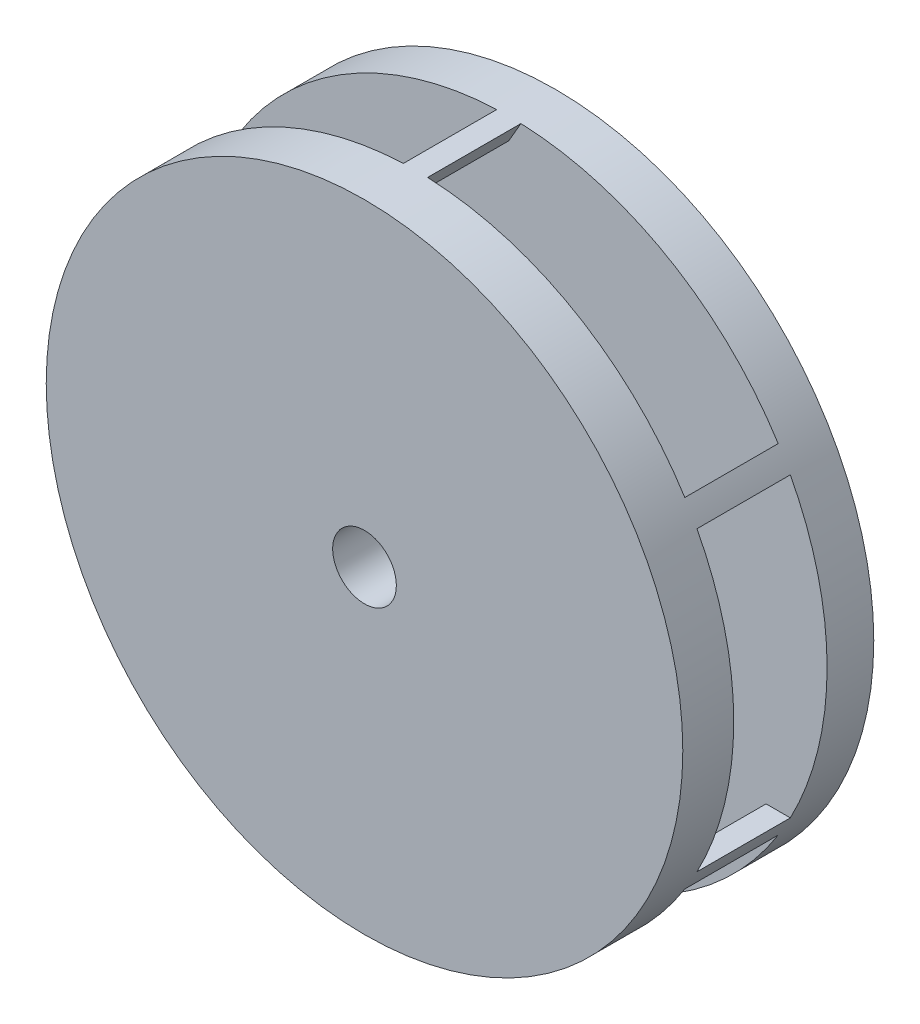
ISO-10303-21;
HEADER;
FILE_DESCRIPTION(('STEP AP214'),'2;1');
FILE_NAME('part.step','',(''),(''),'','','');
FILE_SCHEMA(('AUTOMOTIVE_DESIGN { 1 0 10303 214 1 1 1 1 }'));
ENDSEC;
DATA;
#1=APPLICATION_CONTEXT('core data for automotive mechanical design processes');
#2=APPLICATION_PROTOCOL_DEFINITION('international standard','automotive_design',2000,#1);
#3=PRODUCT_CONTEXT('',#1,'mechanical');
#4=PRODUCT('Part','Part','',(#3));
#5=PRODUCT_RELATED_PRODUCT_CATEGORY('part','',(#4));
#6=PRODUCT_DEFINITION_FORMATION('','',#4);
#7=PRODUCT_DEFINITION_CONTEXT('part definition',#1,'design');
#8=PRODUCT_DEFINITION('design','',#6,#7);
#9=PRODUCT_DEFINITION_SHAPE('','',#8);
#10=(LENGTH_UNIT() NAMED_UNIT(*) SI_UNIT(.MILLI.,.METRE.));
#11=(NAMED_UNIT(*) PLANE_ANGLE_UNIT() SI_UNIT($,.RADIAN.));
#12=(NAMED_UNIT(*) SI_UNIT($,.STERADIAN.) SOLID_ANGLE_UNIT());
#13=UNCERTAINTY_MEASURE_WITH_UNIT(LENGTH_MEASURE(1.E-05),#10,'distance_accuracy_value','');
#14=(GEOMETRIC_REPRESENTATION_CONTEXT(3) GLOBAL_UNCERTAINTY_ASSIGNED_CONTEXT((#13)) GLOBAL_UNIT_ASSIGNED_CONTEXT((#10,
#11,#12)) REPRESENTATION_CONTEXT('',''));
#15=CARTESIAN_POINT('',(0.,0.,0.));
#16=DIRECTION('',(0.,0.,1.));
#17=DIRECTION('',(1.,0.,0.));
#18=AXIS2_PLACEMENT_3D('',#15,#16,#17);
#19=CARTESIAN_POINT('',(-81.5375247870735,71.2271356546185,33.));
#20=DIRECTION('',(-0.86602540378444,-0.499999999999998,0.));
#21=DIRECTION('',(0.499999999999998,-0.86602540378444,0.));
#22=AXIS2_PLACEMENT_3D('',#19,#20,#21);
#23=PLANE('',#22);
#24=DIRECTION('',(0.499999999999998,-0.86602540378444,0.));
#25=VECTOR('',#24,1.);
#26=CARTESIAN_POINT('',(-81.5375247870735,71.2271356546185,11.));
#27=LINE('',#26,#25);
#28=CARTESIAN_POINT('',(-2.56739074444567E-13,-69.9999999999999,11.));
#29=VERTEX_POINT('',#28);
#30=CARTESIAN_POINT('',(2.85535877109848,-74.9456264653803,11.));
#31=VERTEX_POINT('',#30);
#32=EDGE_CURVE('E253',#29,#31,#27,.T.);
#33=ORIENTED_EDGE('',*,*,#32,.F.);
#34=DIRECTION('',(0.,0.,1.));
#35=VECTOR('',#34,1.);
#36=CARTESIAN_POINT('',(-2.4980018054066E-13,-69.9999999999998,33.));
#37=LINE('',#36,#35);
#38=CARTESIAN_POINT('',(-2.35922392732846E-13,-69.9999999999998,33.));
#39=VERTEX_POINT('',#38);
#40=EDGE_CURVE('E213',#29,#39,#37,.T.);
#41=ORIENTED_EDGE('',*,*,#40,.T.);
#42=DIRECTION('',(0.499999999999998,-0.86602540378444,0.));
#43=VECTOR('',#42,1.);
#44=CARTESIAN_POINT('',(-81.5375247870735,71.2271356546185,33.));
#45=LINE('',#44,#43);
#46=CARTESIAN_POINT('',(2.85535877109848,-74.9456264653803,33.));
#47=VERTEX_POINT('',#46);
#48=EDGE_CURVE('E257',#39,#47,#45,.T.);
#49=ORIENTED_EDGE('',*,*,#48,.T.);
#50=DIRECTION('',(0.,0.,-1.));
#51=VECTOR('',#50,1.);
#52=CARTESIAN_POINT('',(2.85535877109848,-74.9456264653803,45.));
#53=LINE('',#52,#51);
#54=EDGE_CURVE('E241',#47,#31,#53,.T.);
#55=ORIENTED_EDGE('',*,*,#54,.T.);
#56=EDGE_LOOP('',(#33,#41,#49,#55));
#57=FACE_BOUND('',#56,.T.);
#58=ADVANCED_FACE('F30',(#57),#23,.F.);
#59=CARTESIAN_POINT('',(-20.9157465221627,106.227135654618,11.));
#60=DIRECTION('',(0.86602540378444,0.499999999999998,0.));
#61=DIRECTION('',(-0.499999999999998,0.86602540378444,0.));
#62=AXIS2_PLACEMENT_3D('',#59,#60,#61);
#63=PLANE('',#62);
#64=DIRECTION('',(0.499999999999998,-0.86602540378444,0.));
#65=VECTOR('',#64,1.);
#66=CARTESIAN_POINT('',(-20.9157465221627,106.227135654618,33.));
#67=LINE('',#66,#65);
#68=CARTESIAN_POINT('',(60.6217782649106,-35.,33.));
#69=VERTEX_POINT('',#68);
#70=CARTESIAN_POINT('',(63.4771370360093,-39.9456264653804,33.));
#71=VERTEX_POINT('',#70);
#72=EDGE_CURVE('E261',#69,#71,#67,.T.);
#73=ORIENTED_EDGE('',*,*,#72,.F.);
#74=DIRECTION('',(0.,0.,-1.));
#75=VECTOR('',#74,1.);
#76=CARTESIAN_POINT('',(60.6217782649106,-35.,11.));
#77=LINE('',#76,#75);
#78=CARTESIAN_POINT('',(60.6217782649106,-35.,11.));
#79=VERTEX_POINT('',#78);
#80=EDGE_CURVE('E172',#69,#79,#77,.T.);
#81=ORIENTED_EDGE('',*,*,#80,.T.);
#82=DIRECTION('',(0.499999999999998,-0.86602540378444,0.));
#83=VECTOR('',#82,1.);
#84=CARTESIAN_POINT('',(-20.9157465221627,106.227135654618,11.));
#85=LINE('',#84,#83);
#86=CARTESIAN_POINT('',(63.4771370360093,-39.9456264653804,11.));
#87=VERTEX_POINT('',#86);
#88=EDGE_CURVE('E249',#79,#87,#85,.T.);
#89=ORIENTED_EDGE('',*,*,#88,.T.);
#90=DIRECTION('',(0.,0.,-1.));
#91=VECTOR('',#90,1.);
#92=CARTESIAN_POINT('',(63.4771370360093,-39.9456264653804,45.));
#93=LINE('',#92,#91);
#94=EDGE_CURVE('E235',#87,#71,#93,.F.);
#95=ORIENTED_EDGE('',*,*,#94,.T.);
#96=EDGE_LOOP('',(#73,#81,#89,#95));
#97=FACE_BOUND('',#96,.T.);
#98=ADVANCED_FACE('F292',(#97),#63,.F.);
#99=CARTESIAN_POINT('',(0.,0.,-15.));
#100=DIRECTION('',(0.,0.,1.));
#101=DIRECTION('',(1.,0.,0.));
#102=AXIS2_PLACEMENT_3D('',#99,#100,#101);
#103=CYLINDRICAL_SURFACE('',#102,30.5);
#104=CARTESIAN_POINT('',(0.,0.,-15.));
#105=DIRECTION('',(0.,0.,-1.));
#106=DIRECTION('',(-1.,0.,0.));
#107=AXIS2_PLACEMENT_3D('',#104,#105,#106);
#108=CIRCLE('',#107,30.5);
#109=CARTESIAN_POINT('',(-30.5,0.,-15.));
#110=VERTEX_POINT('',#109);
#111=EDGE_CURVE('E403',#110,#110,#108,.T.);
#112=ORIENTED_EDGE('',*,*,#111,.F.);
#113=EDGE_LOOP('',(#112));
#114=FACE_BOUND('',#113,.T.);
#115=CARTESIAN_POINT('',(0.,0.,-9.));
#116=DIRECTION('',(0.,0.,1.));
#117=DIRECTION('',(1.,0.,0.));
#118=AXIS2_PLACEMENT_3D('',#115,#116,#117);
#119=CIRCLE('',#118,30.5);
#120=CARTESIAN_POINT('',(30.5,0.,-9.));
#121=VERTEX_POINT('',#120);
#122=EDGE_CURVE('E394',#121,#121,#119,.T.);
#123=ORIENTED_EDGE('',*,*,#122,.F.);
#124=EDGE_LOOP('',(#123));
#125=FACE_BOUND('',#124,.T.);
#126=ADVANCED_FACE('F288',(#114,#125),#103,.T.);
#127=CARTESIAN_POINT('',(0.,0.,-15.));
#128=DIRECTION('',(0.,0.,-1.));
#129=DIRECTION('',(-1.,0.,0.));
#130=AXIS2_PLACEMENT_3D('',#127,#128,#129);
#131=PLANE('',#130);
#132=ORIENTED_EDGE('',*,*,#111,.T.);
#133=EDGE_LOOP('',(#132));
#134=FACE_BOUND('',#133,.T.);
#135=CARTESIAN_POINT('',(0.,0.,-15.));
#136=DIRECTION('',(0.,0.,-1.));
#137=DIRECTION('',(-1.,0.,0.));
#138=AXIS2_PLACEMENT_3D('',#135,#136,#137);
#139=CIRCLE('',#138,25.5);
#140=CARTESIAN_POINT('',(-25.5,0.,-15.));
#141=VERTEX_POINT('',#140);
#142=EDGE_CURVE('E252',#141,#141,#139,.T.);
#143=ORIENTED_EDGE('',*,*,#142,.F.);
#144=EDGE_LOOP('',(#143));
#145=FACE_BOUND('',#144,.T.);
#146=ADVANCED_FACE('F284',(#134,#145),#131,.T.);
#147=CARTESIAN_POINT('',(0.,0.,-15.));
#148=DIRECTION('',(0.,0.,1.));
#149=DIRECTION('',(1.,0.,0.));
#150=AXIS2_PLACEMENT_3D('',#147,#148,#149);
#151=CYLINDRICAL_SURFACE('',#150,25.5);
#152=ORIENTED_EDGE('',*,*,#142,.T.);
#153=EDGE_LOOP('',(#152));
#154=FACE_BOUND('',#153,.T.);
#155=CARTESIAN_POINT('',(0.,0.,11.));
#156=DIRECTION('',(0.,0.,-1.));
#157=DIRECTION('',(-1.,0.,0.));
#158=AXIS2_PLACEMENT_3D('',#155,#156,#157);
#159=CIRCLE('',#158,25.5);
#160=CARTESIAN_POINT('',(-25.5,0.,11.));
#161=VERTEX_POINT('',#160);
#162=EDGE_CURVE('E356',#161,#161,#159,.F.);
#163=ORIENTED_EDGE('',*,*,#162,.T.);
#164=EDGE_LOOP('',(#163));
#165=FACE_BOUND('',#164,.T.);
#166=ADVANCED_FACE('F279',(#154,#165),#151,.F.);
#167=CARTESIAN_POINT('',(-30.5,0.,-9.));
#168=CARTESIAN_POINT('',(-38.5213748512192,0.,-2.27671658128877));
#169=CARTESIAN_POINT('',(-65.5,0.,0.));
#170=B_SPLINE_CURVE_WITH_KNOTS('',2,(#167,#168,#169),.UNSPECIFIED.,.F.,.F.,(3,3),(0.,
0.452791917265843),.UNSPECIFIED.);
#171=CARTESIAN_POINT('',(0.,0.,0.));
#172=DIRECTION('',(0.,0.,1.));
#173=AXIS1_PLACEMENT('',#171,#172);
#174=SURFACE_OF_REVOLUTION('',#170,#173);
#175=CARTESIAN_POINT('',(0.,0.,0.));
#176=DIRECTION('',(0.,0.,1.));
#177=DIRECTION('',(1.,0.,0.));
#178=AXIS2_PLACEMENT_3D('',#175,#176,#177);
#179=CIRCLE('',#178,65.5);
#180=CARTESIAN_POINT('',(65.5,0.,0.));
#181=VERTEX_POINT('',#180);
#182=EDGE_CURVE('E392',#181,#181,#179,.F.);
#183=ORIENTED_EDGE('',*,*,#182,.T.);
#184=EDGE_LOOP('',(#183));
#185=FACE_BOUND('',#184,.T.);
#186=ORIENTED_EDGE('',*,*,#122,.T.);
#187=EDGE_LOOP('',(#186));
#188=FACE_BOUND('',#187,.T.);
#189=ADVANCED_FACE('F274',(#185,#188),#174,.T.);
#190=CARTESIAN_POINT('',(0.,0.,45.));
#191=DIRECTION('',(0.,0.,1.));
#192=DIRECTION('',(1.,0.,0.));
#193=AXIS2_PLACEMENT_3D('',#190,#191,#192);
#194=PLANE('',#193);
#195=CARTESIAN_POINT('',(0.,0.,45.));
#196=DIRECTION('',(0.,0.,1.));
#197=DIRECTION('',(1.,0.,0.));
#198=AXIS2_PLACEMENT_3D('',#195,#196,#197);
#199=CIRCLE('',#198,7.5);
#200=CARTESIAN_POINT('',(7.5,0.,45.));
#201=VERTEX_POINT('',#200);
#202=EDGE_CURVE('E416',#201,#201,#199,.T.);
#203=ORIENTED_EDGE('',*,*,#202,.F.);
#204=EDGE_LOOP('',(#203));
#205=FACE_BOUND('',#204,.T.);
#206=CARTESIAN_POINT('',(0.,0.,45.));
#207=DIRECTION('',(0.,0.,1.));
#208=DIRECTION('',(1.,0.,0.));
#209=AXIS2_PLACEMENT_3D('',#206,#207,#208);
#210=CIRCLE('',#209,75.);
#211=CARTESIAN_POINT('',(75.,0.,45.));
#212=VERTEX_POINT('',#211);
#213=EDGE_CURVE('E399',#212,#212,#210,.T.);
#214=ORIENTED_EDGE('',*,*,#213,.T.);
#215=EDGE_LOOP('',(#214));
#216=FACE_BOUND('',#215,.T.);
#217=ADVANCED_FACE('F278',(#205,#216),#194,.T.);
#218=CARTESIAN_POINT('',(0.,0.,45.));
#219=DIRECTION('',(0.,0.,-1.));
#220=DIRECTION('',(-1.,0.,0.));
#221=AXIS2_PLACEMENT_3D('',#218,#219,#220);
#222=CYLINDRICAL_SURFACE('',#221,75.);
#223=CARTESIAN_POINT('',(0.,0.,11.));
#224=DIRECTION('',(0.,0.,-1.));
#225=DIRECTION('',(-1.,0.,0.));
#226=AXIS2_PLACEMENT_3D('',#223,#224,#225);
#227=CIRCLE('',#226,75.);
#228=CARTESIAN_POINT('',(66.332495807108,35.,11.));
#229=VERTEX_POINT('',#228);
#230=CARTESIAN_POINT('',(66.332495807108,-35.,11.));
#231=VERTEX_POINT('',#230);
#232=EDGE_CURVE('E160',#229,#231,#227,.T.);
#233=ORIENTED_EDGE('',*,*,#232,.T.);
#234=DIRECTION('',(0.,0.,-1.));
#235=VECTOR('',#234,1.);
#236=CARTESIAN_POINT('',(66.332495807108,-35.,45.));
#237=LINE('',#236,#235);
#238=CARTESIAN_POINT('',(66.332495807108,-35.,33.));
#239=VERTEX_POINT('',#238);
#240=EDGE_CURVE('E173',#231,#239,#237,.F.);
#241=ORIENTED_EDGE('',*,*,#240,.T.);
#242=CARTESIAN_POINT('',(0.,0.,33.));
#243=DIRECTION('',(0.,0.,1.));
#244=DIRECTION('',(0.,-1.,0.));
#245=AXIS2_PLACEMENT_3D('',#242,#243,#244);
#246=CIRCLE('',#245,75.);
#247=CARTESIAN_POINT('',(66.332495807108,35.,33.));
#248=VERTEX_POINT('',#247);
#249=EDGE_CURVE('E179',#239,#248,#246,.T.);
#250=ORIENTED_EDGE('',*,*,#249,.T.);
#251=DIRECTION('',(0.,0.,-1.));
#252=VECTOR('',#251,1.);
#253=CARTESIAN_POINT('',(66.332495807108,35.,45.));
#254=LINE('',#253,#252);
#255=EDGE_CURVE('E187',#248,#229,#254,.T.);
#256=ORIENTED_EDGE('',*,*,#255,.T.);
#257=EDGE_LOOP('',(#233,#241,#250,#256));
#258=FACE_BOUND('',#257,.T.);
#259=CARTESIAN_POINT('',(-66.332495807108,35.,33.));
#260=VERTEX_POINT('',#259);
#261=CARTESIAN_POINT('',(-66.332495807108,-35.,33.));
#262=VERTEX_POINT('',#261);
#263=EDGE_CURVE('E171',#260,#262,#246,.T.);
#264=ORIENTED_EDGE('',*,*,#263,.T.);
#265=DIRECTION('',(0.,0.,-1.));
#266=VECTOR('',#265,1.);
#267=CARTESIAN_POINT('',(-66.332495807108,-35.,45.));
#268=LINE('',#267,#266);
#269=CARTESIAN_POINT('',(-66.332495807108,-35.,11.));
#270=VERTEX_POINT('',#269);
#271=EDGE_CURVE('E164',#262,#270,#268,.T.);
#272=ORIENTED_EDGE('',*,*,#271,.T.);
#273=CARTESIAN_POINT('',(-66.332495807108,35.,11.));
#274=VERTEX_POINT('',#273);
#275=EDGE_CURVE('E152',#270,#274,#227,.T.);
#276=ORIENTED_EDGE('',*,*,#275,.T.);
#277=DIRECTION('',(0.,0.,-1.));
#278=VECTOR('',#277,1.);
#279=CARTESIAN_POINT('',(-66.332495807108,35.,45.));
#280=LINE('',#279,#278);
#281=EDGE_CURVE('E185',#274,#260,#280,.F.);
#282=ORIENTED_EDGE('',*,*,#281,.T.);
#283=EDGE_LOOP('',(#264,#272,#276,#282));
#284=FACE_BOUND('',#283,.T.);
#285=CARTESIAN_POINT('',(0.,0.,33.));
#286=DIRECTION('',(0.,0.,1.));
#287=DIRECTION('',(1.,0.,0.));
#288=AXIS2_PLACEMENT_3D('',#285,#286,#287);
#289=CIRCLE('',#288,75.);
#290=CARTESIAN_POINT('',(-63.4771370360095,-39.94562646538,33.));
#291=VERTEX_POINT('',#290);
#292=CARTESIAN_POINT('',(-2.855358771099,-74.9456264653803,33.));
#293=VERTEX_POINT('',#292);
#294=EDGE_CURVE('E226',#291,#293,#289,.T.);
#295=ORIENTED_EDGE('',*,*,#294,.T.);
#296=DIRECTION('',(0.,0.,-1.));
#297=VECTOR('',#296,1.);
#298=CARTESIAN_POINT('',(-2.85535877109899,-74.9456264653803,45.));
#299=LINE('',#298,#297);
#300=CARTESIAN_POINT('',(-2.855358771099,-74.9456264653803,11.));
#301=VERTEX_POINT('',#300);
#302=EDGE_CURVE('E219',#293,#301,#299,.T.);
#303=ORIENTED_EDGE('',*,*,#302,.T.);
#304=CARTESIAN_POINT('',(0.,0.,11.));
#305=DIRECTION('',(0.,0.,-1.));
#306=DIRECTION('',(-1.,0.,0.));
#307=AXIS2_PLACEMENT_3D('',#304,#305,#306);
#308=CIRCLE('',#307,75.);
#309=CARTESIAN_POINT('',(-63.4771370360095,-39.94562646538,11.));
#310=VERTEX_POINT('',#309);
#311=EDGE_CURVE('E222',#301,#310,#308,.T.);
#312=ORIENTED_EDGE('',*,*,#311,.T.);
#313=DIRECTION('',(0.,0.,-1.));
#314=VECTOR('',#313,1.);
#315=CARTESIAN_POINT('',(-63.4771370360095,-39.94562646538,45.));
#316=LINE('',#315,#314);
#317=EDGE_CURVE('E207',#310,#291,#316,.F.);
#318=ORIENTED_EDGE('',*,*,#317,.T.);
#319=EDGE_LOOP('',(#295,#303,#312,#318));
#320=FACE_BOUND('',#319,.T.);
#321=DIRECTION('',(0.,0.,-1.));
#322=VECTOR('',#321,1.);
#323=CARTESIAN_POINT('',(2.855358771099,74.9456264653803,45.));
#324=LINE('',#323,#322);
#325=CARTESIAN_POINT('',(2.85535877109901,74.9456264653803,33.));
#326=VERTEX_POINT('',#325);
#327=CARTESIAN_POINT('',(2.85535877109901,74.9456264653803,11.));
#328=VERTEX_POINT('',#327);
#329=EDGE_CURVE('E210',#326,#328,#324,.T.);
#330=ORIENTED_EDGE('',*,*,#329,.T.);
#331=CARTESIAN_POINT('',(63.4771370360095,39.94562646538,11.));
#332=VERTEX_POINT('',#331);
#333=EDGE_CURVE('E225',#328,#332,#308,.T.);
#334=ORIENTED_EDGE('',*,*,#333,.T.);
#335=DIRECTION('',(0.,0.,-1.));
#336=VECTOR('',#335,1.);
#337=CARTESIAN_POINT('',(63.4771370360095,39.94562646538,45.));
#338=LINE('',#337,#336);
#339=CARTESIAN_POINT('',(63.4771370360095,39.94562646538,33.));
#340=VERTEX_POINT('',#339);
#341=EDGE_CURVE('E216',#332,#340,#338,.F.);
#342=ORIENTED_EDGE('',*,*,#341,.T.);
#343=EDGE_CURVE('E229',#340,#326,#289,.T.);
#344=ORIENTED_EDGE('',*,*,#343,.T.);
#345=EDGE_LOOP('',(#330,#334,#342,#344));
#346=FACE_BOUND('',#345,.T.);
#347=CARTESIAN_POINT('',(0.,0.,33.));
#348=DIRECTION('',(0.,0.,1.));
#349=DIRECTION('',(1.,0.,0.));
#350=AXIS2_PLACEMENT_3D('',#347,#348,#349);
#351=CIRCLE('',#350,75.);
#352=CARTESIAN_POINT('',(-63.4771370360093,39.9456264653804,33.));
#353=VERTEX_POINT('',#352);
#354=CARTESIAN_POINT('',(-2.85535877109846,74.9456264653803,33.));
#355=VERTEX_POINT('',#354);
#356=EDGE_CURVE('E242',#353,#355,#351,.F.);
#357=ORIENTED_EDGE('',*,*,#356,.F.);
#358=DIRECTION('',(0.,0.,-1.));
#359=VECTOR('',#358,1.);
#360=CARTESIAN_POINT('',(-63.4771370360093,39.9456264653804,45.));
#361=LINE('',#360,#359);
#362=CARTESIAN_POINT('',(-63.4771370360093,39.9456264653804,11.));
#363=VERTEX_POINT('',#362);
#364=EDGE_CURVE('E246',#363,#353,#361,.F.);
#365=ORIENTED_EDGE('',*,*,#364,.F.);
#366=CARTESIAN_POINT('',(0.,0.,11.));
#367=DIRECTION('',(0.,0.,-1.));
#368=DIRECTION('',(-1.,0.,0.));
#369=AXIS2_PLACEMENT_3D('',#366,#367,#368);
#370=CIRCLE('',#369,75.);
#371=CARTESIAN_POINT('',(-2.85535877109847,74.9456264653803,11.));
#372=VERTEX_POINT('',#371);
#373=EDGE_CURVE('E230',#372,#363,#370,.F.);
#374=ORIENTED_EDGE('',*,*,#373,.F.);
#375=DIRECTION('',(0.,0.,-1.));
#376=VECTOR('',#375,1.);
#377=CARTESIAN_POINT('',(-2.85535877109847,74.9456264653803,45.));
#378=LINE('',#377,#376);
#379=EDGE_CURVE('E233',#355,#372,#378,.T.);
#380=ORIENTED_EDGE('',*,*,#379,.F.);
#381=EDGE_LOOP('',(#357,#365,#374,#380));
#382=FACE_BOUND('',#381,.T.);
#383=EDGE_CURVE('E234',#31,#87,#370,.F.);
#384=ORIENTED_EDGE('',*,*,#383,.F.);
#385=ORIENTED_EDGE('',*,*,#54,.F.);
#386=EDGE_CURVE('E238',#71,#47,#351,.F.);
#387=ORIENTED_EDGE('',*,*,#386,.F.);
#388=ORIENTED_EDGE('',*,*,#94,.F.);
#389=EDGE_LOOP('',(#384,#385,#387,#388));
#390=FACE_BOUND('',#389,.T.);
#391=ORIENTED_EDGE('',*,*,#213,.F.);
#392=EDGE_LOOP('',(#391));
#393=FACE_BOUND('',#392,.T.);
#394=CARTESIAN_POINT('',(0.,0.,0.));
#395=DIRECTION('',(0.,0.,1.));
#396=DIRECTION('',(1.,0.,0.));
#397=AXIS2_PLACEMENT_3D('',#394,#395,#396);
#398=CIRCLE('',#397,75.);
#399=CARTESIAN_POINT('',(75.,0.,0.));
#400=VERTEX_POINT('',#399);
#401=EDGE_CURVE('E400',#400,#400,#398,.T.);
#402=ORIENTED_EDGE('',*,*,#401,.T.);
#403=EDGE_LOOP('',(#402));
#404=FACE_BOUND('',#403,.T.);
#405=ADVANCED_FACE('F32',(#258,#284,#320,#346,#382,#390,#393,#404),#222,.T.);
#406=CARTESIAN_POINT('',(0.,0.,0.));
#407=DIRECTION('',(0.,0.,1.));
#408=DIRECTION('',(1.,0.,0.));
#409=AXIS2_PLACEMENT_3D('',#406,#407,#408);
#410=PLANE('',#409);
#411=ORIENTED_EDGE('',*,*,#401,.F.);
#412=EDGE_LOOP('',(#411));
#413=FACE_BOUND('',#412,.T.);
#414=ORIENTED_EDGE('',*,*,#182,.F.);
#415=EDGE_LOOP('',(#414));
#416=FACE_BOUND('',#415,.T.);
#417=ADVANCED_FACE('F296',(#413,#416),#410,.F.);
#418=CARTESIAN_POINT('',(-60.6217782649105,35.,33.));
#419=VERTEX_POINT('',#418);
#420=EDGE_CURVE('E254',#353,#419,#45,.T.);
#421=ORIENTED_EDGE('',*,*,#420,.T.);
#422=DIRECTION('',(0.,0.,-1.));
#423=VECTOR('',#422,1.);
#424=CARTESIAN_POINT('',(-60.6217782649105,35.,33.));
#425=LINE('',#424,#423);
#426=CARTESIAN_POINT('',(-60.6217782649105,35.,11.));
#427=VERTEX_POINT('',#426);
#428=EDGE_CURVE('E176',#419,#427,#425,.T.);
#429=ORIENTED_EDGE('',*,*,#428,.T.);
#430=EDGE_CURVE('E250',#363,#427,#27,.T.);
#431=ORIENTED_EDGE('',*,*,#430,.F.);
#432=ORIENTED_EDGE('',*,*,#364,.T.);
#433=EDGE_LOOP('',(#421,#429,#431,#432));
#434=FACE_BOUND('',#433,.T.);
#435=ADVANCED_FACE('F298',(#434),#23,.F.);
#436=CARTESIAN_POINT('',(-20.9157465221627,106.227135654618,33.));
#437=DIRECTION('',(0.,0.,1.));
#438=DIRECTION('',(1.,0.,0.));
#439=AXIS2_PLACEMENT_3D('',#436,#437,#438);
#440=PLANE('',#439);
#441=CARTESIAN_POINT('',(0.,0.,33.));
#442=DIRECTION('',(0.,0.,1.));
#443=DIRECTION('',(1.,0.,0.));
#444=AXIS2_PLACEMENT_3D('',#441,#442,#443);
#445=CIRCLE('',#444,7.5);
#446=CARTESIAN_POINT('',(7.5,0.,33.));
#447=VERTEX_POINT('',#446);
#448=EDGE_CURVE('E413',#447,#447,#445,.F.);
#449=ORIENTED_EDGE('',*,*,#448,.F.);
#450=EDGE_LOOP('',(#449));
#451=FACE_BOUND('',#450,.T.);
#452=DIRECTION('',(1.,0.,0.));
#453=VECTOR('',#452,1.);
#454=CARTESIAN_POINT('',(-76.5,-35.,33.));
#455=LINE('',#454,#453);
#456=EDGE_CURVE('E346',#69,#239,#455,.T.);
#457=ORIENTED_EDGE('',*,*,#456,.F.);
#458=ORIENTED_EDGE('',*,*,#72,.T.);
#459=ORIENTED_EDGE('',*,*,#386,.T.);
#460=ORIENTED_EDGE('',*,*,#48,.F.);
#461=DIRECTION('',(0.500000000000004,0.866025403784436,0.));
#462=VECTOR('',#461,1.);
#463=CARTESIAN_POINT('',(-19.1891108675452,-103.236514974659,33.));
#464=LINE('',#463,#462);
#465=EDGE_CURVE('E194',#293,#39,#464,.T.);
#466=ORIENTED_EDGE('',*,*,#465,.F.);
#467=ORIENTED_EDGE('',*,*,#294,.F.);
#468=DIRECTION('',(0.500000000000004,0.866025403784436,0.));
#469=VECTOR('',#468,1.);
#470=CARTESIAN_POINT('',(-79.8108891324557,-68.2365149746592,33.));
#471=LINE('',#470,#469);
#472=CARTESIAN_POINT('',(-60.621778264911,-35.,33.));
#473=VERTEX_POINT('',#472);
#474=EDGE_CURVE('E197',#291,#473,#471,.T.);
#475=ORIENTED_EDGE('',*,*,#474,.T.);
#476=EDGE_CURVE('E350',#262,#473,#455,.T.);
#477=ORIENTED_EDGE('',*,*,#476,.F.);
#478=ORIENTED_EDGE('',*,*,#263,.F.);
#479=DIRECTION('',(1.,0.,0.));
#480=VECTOR('',#479,1.);
#481=CARTESIAN_POINT('',(-76.5,35.,33.));
#482=LINE('',#481,#480);
#483=EDGE_CURVE('E343',#260,#419,#482,.T.);
#484=ORIENTED_EDGE('',*,*,#483,.T.);
#485=ORIENTED_EDGE('',*,*,#420,.F.);
#486=ORIENTED_EDGE('',*,*,#356,.T.);
#487=CARTESIAN_POINT('',(2.4980018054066E-13,69.9999999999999,33.));
#488=VERTEX_POINT('',#487);
#489=EDGE_CURVE('E258',#355,#488,#67,.T.);
#490=ORIENTED_EDGE('',*,*,#489,.T.);
#491=EDGE_CURVE('E198',#488,#326,#471,.T.);
#492=ORIENTED_EDGE('',*,*,#491,.T.);
#493=ORIENTED_EDGE('',*,*,#343,.F.);
#494=CARTESIAN_POINT('',(60.621778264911,35.,33.));
#495=VERTEX_POINT('',#494);
#496=EDGE_CURVE('E195',#495,#340,#464,.T.);
#497=ORIENTED_EDGE('',*,*,#496,.F.);
#498=EDGE_CURVE('E347',#495,#248,#482,.T.);
#499=ORIENTED_EDGE('',*,*,#498,.T.);
#500=ORIENTED_EDGE('',*,*,#249,.F.);
#501=EDGE_LOOP('',(#457,#458,#459,#460,#466,#467,#475,#477,#478,#484,#485,#486,#490,#492,#493,
#497,#499,#500));
#502=FACE_BOUND('',#501,.T.);
#503=ADVANCED_FACE('F304',(#451,#502),#440,.F.);
#504=CARTESIAN_POINT('',(2.4459601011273E-13,69.9999999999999,11.));
#505=VERTEX_POINT('',#504);
#506=EDGE_CURVE('E262',#372,#505,#85,.T.);
#507=ORIENTED_EDGE('',*,*,#506,.T.);
#508=DIRECTION('',(0.,0.,1.));
#509=VECTOR('',#508,1.);
#510=CARTESIAN_POINT('',(2.56739074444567E-13,69.9999999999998,11.));
#511=LINE('',#510,#509);
#512=EDGE_CURVE('E204',#505,#488,#511,.T.);
#513=ORIENTED_EDGE('',*,*,#512,.T.);
#514=ORIENTED_EDGE('',*,*,#489,.F.);
#515=ORIENTED_EDGE('',*,*,#379,.T.);
#516=EDGE_LOOP('',(#507,#513,#514,#515));
#517=FACE_BOUND('',#516,.T.);
#518=ADVANCED_FACE('F316',(#517),#63,.F.);
#519=CARTESIAN_POINT('',(-51.2266356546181,88.7271356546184,11.));
#520=DIRECTION('',(0.,0.,-1.));
#521=DIRECTION('',(-1.,0.,0.));
#522=AXIS2_PLACEMENT_3D('',#519,#520,#521);
#523=PLANE('',#522);
#524=ORIENTED_EDGE('',*,*,#162,.F.);
#525=EDGE_LOOP('',(#524));
#526=FACE_BOUND('',#525,.T.);
#527=ORIENTED_EDGE('',*,*,#88,.F.);
#528=DIRECTION('',(1.,0.,0.));
#529=VECTOR('',#528,1.);
#530=CARTESIAN_POINT('',(-76.5,-35.,11.));
#531=LINE('',#530,#529);
#532=EDGE_CURVE('E45',#79,#231,#531,.T.);
#533=ORIENTED_EDGE('',*,*,#532,.T.);
#534=ORIENTED_EDGE('',*,*,#232,.F.);
#535=DIRECTION('',(1.,0.,0.));
#536=VECTOR('',#535,1.);
#537=CARTESIAN_POINT('',(-76.5,35.,11.));
#538=LINE('',#537,#536);
#539=CARTESIAN_POINT('',(60.6217782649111,35.,11.));
#540=VERTEX_POINT('',#539);
#541=EDGE_CURVE('E354',#540,#229,#538,.T.);
#542=ORIENTED_EDGE('',*,*,#541,.F.);
#543=DIRECTION('',(0.500000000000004,0.866025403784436,0.));
#544=VECTOR('',#543,1.);
#545=CARTESIAN_POINT('',(-19.1891108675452,-103.236514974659,11.));
#546=LINE('',#545,#544);
#547=EDGE_CURVE('E191',#540,#332,#546,.T.);
#548=ORIENTED_EDGE('',*,*,#547,.T.);
#549=ORIENTED_EDGE('',*,*,#333,.F.);
#550=DIRECTION('',(0.500000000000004,0.866025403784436,0.));
#551=VECTOR('',#550,1.);
#552=CARTESIAN_POINT('',(-79.8108891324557,-68.2365149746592,11.));
#553=LINE('',#552,#551);
#554=EDGE_CURVE('E190',#505,#328,#553,.T.);
#555=ORIENTED_EDGE('',*,*,#554,.F.);
#556=ORIENTED_EDGE('',*,*,#506,.F.);
#557=ORIENTED_EDGE('',*,*,#373,.T.);
#558=ORIENTED_EDGE('',*,*,#430,.T.);
#559=EDGE_CURVE('E52',#274,#427,#538,.T.);
#560=ORIENTED_EDGE('',*,*,#559,.F.);
#561=ORIENTED_EDGE('',*,*,#275,.F.);
#562=CARTESIAN_POINT('',(-60.621778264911,-35.,11.));
#563=VERTEX_POINT('',#562);
#564=EDGE_CURVE('E155',#270,#563,#531,.T.);
#565=ORIENTED_EDGE('',*,*,#564,.T.);
#566=EDGE_CURVE('E201',#310,#563,#553,.T.);
#567=ORIENTED_EDGE('',*,*,#566,.F.);
#568=ORIENTED_EDGE('',*,*,#311,.F.);
#569=EDGE_CURVE('E193',#301,#29,#546,.T.);
#570=ORIENTED_EDGE('',*,*,#569,.T.);
#571=ORIENTED_EDGE('',*,*,#32,.T.);
#572=ORIENTED_EDGE('',*,*,#383,.T.);
#573=EDGE_LOOP('',(#527,#533,#534,#542,#548,#549,#555,#556,#557,#558,#560,#561,#565,#567,#568,
#570,#571,#572));
#574=FACE_BOUND('',#573,.T.);
#575=ADVANCED_FACE('F154',(#526,#574),#523,.F.);
#576=CARTESIAN_POINT('',(-79.8108891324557,-68.2365149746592,11.));
#577=DIRECTION('',(-0.866025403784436,0.500000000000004,0.));
#578=DIRECTION('',(-0.500000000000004,-0.866025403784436,0.));
#579=AXIS2_PLACEMENT_3D('',#576,#577,#578);
#580=PLANE('',#579);
#581=ORIENTED_EDGE('',*,*,#491,.F.);
#582=ORIENTED_EDGE('',*,*,#512,.F.);
#583=ORIENTED_EDGE('',*,*,#554,.T.);
#584=ORIENTED_EDGE('',*,*,#329,.F.);
#585=EDGE_LOOP('',(#581,#582,#583,#584));
#586=FACE_BOUND('',#585,.T.);
#587=ADVANCED_FACE('F320',(#586),#580,.F.);
#588=CARTESIAN_POINT('',(-19.1891108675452,-103.236514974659,33.));
#589=DIRECTION('',(0.866025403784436,-0.500000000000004,0.));
#590=DIRECTION('',(0.500000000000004,0.866025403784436,0.));
#591=AXIS2_PLACEMENT_3D('',#588,#589,#590);
#592=PLANE('',#591);
#593=ORIENTED_EDGE('',*,*,#547,.F.);
#594=DIRECTION('',(0.,0.,1.));
#595=VECTOR('',#594,1.);
#596=CARTESIAN_POINT('',(60.621778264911,35.,33.));
#597=LINE('',#596,#595);
#598=EDGE_CURVE('E11',#540,#495,#597,.T.);
#599=ORIENTED_EDGE('',*,*,#598,.T.);
#600=ORIENTED_EDGE('',*,*,#496,.T.);
#601=ORIENTED_EDGE('',*,*,#341,.F.);
#602=EDGE_LOOP('',(#593,#599,#600,#601));
#603=FACE_BOUND('',#602,.T.);
#604=ADVANCED_FACE('F366',(#603),#592,.F.);
#605=ORIENTED_EDGE('',*,*,#465,.T.);
#606=ORIENTED_EDGE('',*,*,#40,.F.);
#607=ORIENTED_EDGE('',*,*,#569,.F.);
#608=ORIENTED_EDGE('',*,*,#302,.F.);
#609=EDGE_LOOP('',(#605,#606,#607,#608));
#610=FACE_BOUND('',#609,.T.);
#611=ADVANCED_FACE('F386',(#610),#592,.F.);
#612=ORIENTED_EDGE('',*,*,#566,.T.);
#613=DIRECTION('',(0.,0.,1.));
#614=VECTOR('',#613,1.);
#615=CARTESIAN_POINT('',(-60.621778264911,-35.,11.));
#616=LINE('',#615,#614);
#617=EDGE_CURVE('E38',#563,#473,#616,.T.);
#618=ORIENTED_EDGE('',*,*,#617,.T.);
#619=ORIENTED_EDGE('',*,*,#474,.F.);
#620=ORIENTED_EDGE('',*,*,#317,.F.);
#621=EDGE_LOOP('',(#612,#618,#619,#620));
#622=FACE_BOUND('',#621,.T.);
#623=ADVANCED_FACE('F391',(#622),#580,.F.);
#624=CARTESIAN_POINT('',(-76.5,-35.,33.));
#625=DIRECTION('',(0.,-1.,0.));
#626=DIRECTION('',(0.,0.,-1.));
#627=AXIS2_PLACEMENT_3D('',#624,#625,#626);
#628=PLANE('',#627);
#629=ORIENTED_EDGE('',*,*,#476,.T.);
#630=ORIENTED_EDGE('',*,*,#617,.F.);
#631=ORIENTED_EDGE('',*,*,#564,.F.);
#632=ORIENTED_EDGE('',*,*,#271,.F.);
#633=EDGE_LOOP('',(#629,#630,#631,#632));
#634=FACE_BOUND('',#633,.T.);
#635=ADVANCED_FACE('F163',(#634),#628,.F.);
#636=CARTESIAN_POINT('',(-76.5,35.,11.));
#637=DIRECTION('',(0.,1.,0.));
#638=DIRECTION('',(0.,0.,1.));
#639=AXIS2_PLACEMENT_3D('',#636,#637,#638);
#640=PLANE('',#639);
#641=ORIENTED_EDGE('',*,*,#559,.T.);
#642=ORIENTED_EDGE('',*,*,#428,.F.);
#643=ORIENTED_EDGE('',*,*,#483,.F.);
#644=ORIENTED_EDGE('',*,*,#281,.F.);
#645=EDGE_LOOP('',(#641,#642,#643,#644));
#646=FACE_BOUND('',#645,.T.);
#647=ADVANCED_FACE('F342',(#646),#640,.F.);
#648=ORIENTED_EDGE('',*,*,#498,.F.);
#649=ORIENTED_EDGE('',*,*,#598,.F.);
#650=ORIENTED_EDGE('',*,*,#541,.T.);
#651=ORIENTED_EDGE('',*,*,#255,.F.);
#652=EDGE_LOOP('',(#648,#649,#650,#651));
#653=FACE_BOUND('',#652,.T.);
#654=ADVANCED_FACE('F361',(#653),#640,.F.);
#655=ORIENTED_EDGE('',*,*,#456,.T.);
#656=ORIENTED_EDGE('',*,*,#240,.F.);
#657=ORIENTED_EDGE('',*,*,#532,.F.);
#658=ORIENTED_EDGE('',*,*,#80,.F.);
#659=EDGE_LOOP('',(#655,#656,#657,#658));
#660=FACE_BOUND('',#659,.T.);
#661=ADVANCED_FACE('F374',(#660),#628,.F.);
#662=CARTESIAN_POINT('',(0.,0.,-15.001));
#663=DIRECTION('',(0.,0.,1.));
#664=DIRECTION('',(1.,0.,0.));
#665=AXIS2_PLACEMENT_3D('',#662,#663,#664);
#666=CYLINDRICAL_SURFACE('',#665,7.5);
#667=ORIENTED_EDGE('',*,*,#202,.T.);
#668=EDGE_LOOP('',(#667));
#669=FACE_BOUND('',#668,.T.);
#670=ORIENTED_EDGE('',*,*,#448,.T.);
#671=EDGE_LOOP('',(#670));
#672=FACE_BOUND('',#671,.T.);
#673=ADVANCED_FACE('F422',(#669,#672),#666,.F.);
#674=CLOSED_SHELL('',(#58,#98,#126,#146,#166,#189,#217,#405,#417,#435,#503,#518,#575,#587,#604,
#611,#623,#635,#647,#654,#661,#673));
#675=MANIFOLD_SOLID_BREP('B2',#674);
#676=ADVANCED_BREP_SHAPE_REPRESENTATION('',(#18,#675),#14);
#677=SHAPE_DEFINITION_REPRESENTATION(#9,#676);
ENDSEC;
END-ISO-10303-21;
